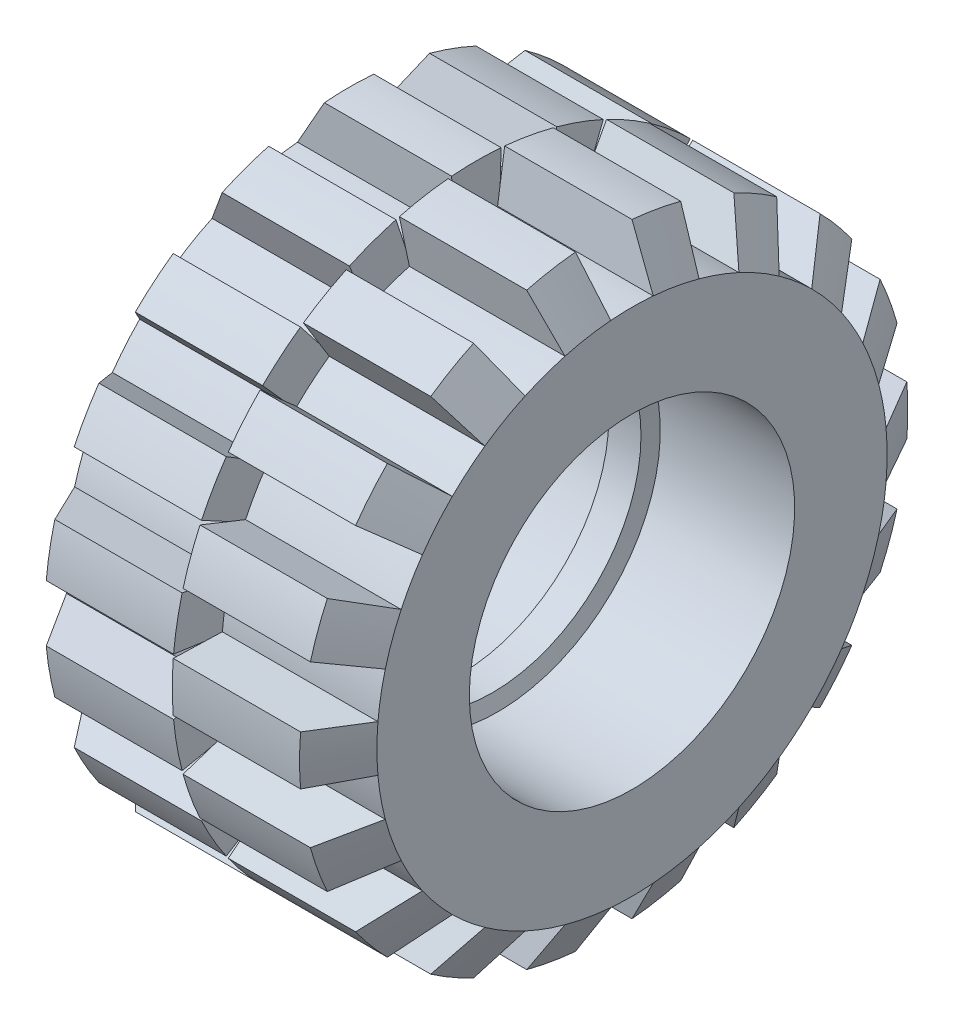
from build123d import *

# Parameters (mm, degrees)
ENL_V_START                  = -5.5
ENL_V_MAT_EXTRU_1_DEPTH      = 5.5
R_P_TITION_CIRCULAIRE1_COUNT = 18
ENL_V_MAT_EXTRU_2_DEPTH      = 5.5
R_P_TITION_CIRCULAIRE2_COUNT = 18


with BuildPart() as part:
    # Esquisse1 → Base-R_volution (revolve)
    with BuildSketch(Plane.XY, mode=Mode.PRIVATE) as base_r_volution_sk:
        Polygon((-5.915761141, 5.75), (-1.165761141, 5.75), (-0.983776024, 5.25), (0.152253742, 5.25), (0.334238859, 5.75), (5.084238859, 5.75), (5.084238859, 9.017949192), (4.084238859, 10.75), (-4.915761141, 10.75), (-5.915761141, 9.017949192), align=None)
    revolve(base_r_volution_sk.sketch.rotate(Axis((-8.541242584, 0, 0), (1, 0, 0)), 90), axis=Axis((-8.541242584, 0, 0), (1, 0, 0)))

    # Esquisse2 → Enl_v. mat.-Extru.1 (cut)
    with BuildSketch(Plane(origin=(5.084238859, 0, 0), x_dir=(0, 0, -1), z_dir=(1, 0, 0)).offset(ENL_V_START)):
        with BuildLine():
            Line((-0.75, 8.986707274), (-1, 10.703387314))
            ThreePointArc((-1, 10.703387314), (0, 10.75), (1, 10.703387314))
            Line((1, 10.703387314), (0.75, 8.986707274))
            ThreePointArc((0.75, 8.986707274), (0, 9.017949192), (-0.75, 8.986707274))
        make_face()
    enl_v_mat_extru_1 = extrude(amount=ENL_V_MAT_EXTRU_1_DEPTH, mode=Mode.SUBTRACT)

    # R_p_tition circulaire1: Enl_v. mat.-Extru.1 ×18 about axis
    r_p_tition_circulaire1_axis = Axis((0, 0, 0), (1, 0, 0))
    for i in range(1, R_P_TITION_CIRCULAIRE1_COUNT):
        add(enl_v_mat_extru_1.rotate(r_p_tition_circulaire1_axis, i * 360 / R_P_TITION_CIRCULAIRE1_COUNT), mode=Mode.SUBTRACT)

    # Esquisse3 → Enl_v. mat.-Extru.2 (cut)
    with BuildSketch(Plane.ZY.offset(5.915761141)):
        with BuildLine():
            Line((-2.843431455, 10.367130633), (-2.299131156, 8.719942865))
            ThreePointArc((-2.299131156, 8.719942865), (-1.565950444, 8.880946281), (-0.821919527, 8.980415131))
            Line((-0.821919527, 8.980415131), (-0.873815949, 10.714426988))
            ThreePointArc((-0.873815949, 10.714426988), (-1.86671791, 10.586683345), (-2.843431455, 10.367130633))
        make_face()
    enl_v_mat_extru_2 = extrude(amount=-ENL_V_MAT_EXTRU_2_DEPTH, mode=Mode.SUBTRACT)

    # R_p_tition circulaire2: Enl_v. mat.-Extru.2 ×18 about axis
    r_p_tition_circulaire2_axis = Axis((0, 0, 0), (1, 0, 0))
    for i in range(1, R_P_TITION_CIRCULAIRE2_COUNT):
        add(enl_v_mat_extru_2.rotate(r_p_tition_circulaire2_axis, i * 360 / R_P_TITION_CIRCULAIRE2_COUNT), mode=Mode.SUBTRACT)


solid = part.part
